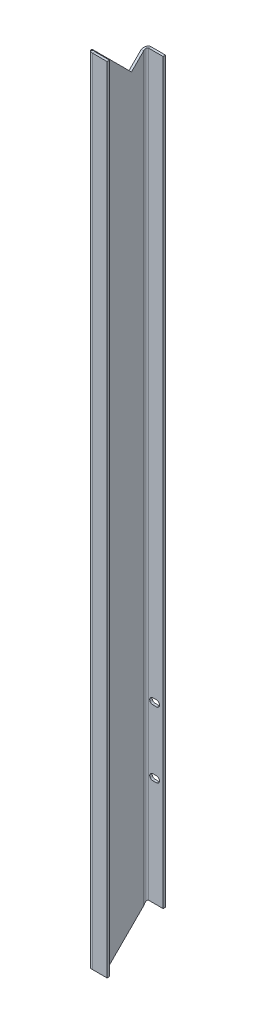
ISO-10303-21;
HEADER;
FILE_DESCRIPTION(('STEP AP214'),'2;1');
FILE_NAME('part.step','',(''),(''),'','','');
FILE_SCHEMA(('AUTOMOTIVE_DESIGN { 1 0 10303 214 1 1 1 1 }'));
ENDSEC;
DATA;
#1=APPLICATION_CONTEXT('core data for automotive mechanical design processes');
#2=APPLICATION_PROTOCOL_DEFINITION('international standard','automotive_design',2000,#1);
#3=PRODUCT_CONTEXT('',#1,'mechanical');
#4=PRODUCT('Part','Part','',(#3));
#5=PRODUCT_RELATED_PRODUCT_CATEGORY('part','',(#4));
#6=PRODUCT_DEFINITION_FORMATION('','',#4);
#7=PRODUCT_DEFINITION_CONTEXT('part definition',#1,'design');
#8=PRODUCT_DEFINITION('design','',#6,#7);
#9=PRODUCT_DEFINITION_SHAPE('','',#8);
#10=(LENGTH_UNIT() NAMED_UNIT(*) SI_UNIT(.MILLI.,.METRE.));
#11=(NAMED_UNIT(*) PLANE_ANGLE_UNIT() SI_UNIT($,.RADIAN.));
#12=(NAMED_UNIT(*) SI_UNIT($,.STERADIAN.) SOLID_ANGLE_UNIT());
#13=UNCERTAINTY_MEASURE_WITH_UNIT(LENGTH_MEASURE(1.E-05),#10,'distance_accuracy_value','');
#14=(GEOMETRIC_REPRESENTATION_CONTEXT(3) GLOBAL_UNCERTAINTY_ASSIGNED_CONTEXT((#13)) GLOBAL_UNIT_ASSIGNED_CONTEXT((#10,
#11,#12)) REPRESENTATION_CONTEXT('',''));
#15=CARTESIAN_POINT('',(0.,0.,0.));
#16=DIRECTION('',(0.,0.,1.));
#17=DIRECTION('',(1.,0.,0.));
#18=AXIS2_PLACEMENT_3D('',#15,#16,#17);
#19=CARTESIAN_POINT('',(0.,2120.9,0.));
#20=DIRECTION('',(-1.,0.,0.));
#21=DIRECTION('',(0.,0.,1.));
#22=AXIS2_PLACEMENT_3D('',#19,#20,#21);
#23=PLANE('',#22);
#24=DIRECTION('',(0.,-1.,0.));
#25=VECTOR('',#24,1.);
#26=CARTESIAN_POINT('',(0.,2120.9,-139.7));
#27=LINE('',#26,#25);
#28=CARTESIAN_POINT('',(0.,2052.8915,-139.7));
#29=VERTEX_POINT('',#28);
#30=CARTESIAN_POINT('',(0.,123.233524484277,-139.7));
#31=VERTEX_POINT('',#30);
#32=EDGE_CURVE('E253',#29,#31,#27,.T.);
#33=ORIENTED_EDGE('',*,*,#32,.T.);
#34=DIRECTION('',(0.,0.707106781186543,-0.707106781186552));
#35=VECTOR('',#34,1.);
#36=CARTESIAN_POINT('',(0.,17.9605122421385,-34.4269877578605));
#37=LINE('',#36,#35);
#38=CARTESIAN_POINT('',(0.,17.9605122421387,-34.4269877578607));
#39=VERTEX_POINT('',#38);
#40=EDGE_CURVE('E214',#39,#31,#37,.T.);
#41=ORIENTED_EDGE('',*,*,#40,.F.);
#42=DIRECTION('',(0.,0.707106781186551,0.707106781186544));
#43=VECTOR('',#42,1.);
#44=CARTESIAN_POINT('',(0.,1086.64375000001,1034.25625));
#45=LINE('',#44,#43);
#46=CARTESIAN_POINT('',(0.,39.6874999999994,-12.6999999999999));
#47=VERTEX_POINT('',#46);
#48=EDGE_CURVE('E350',#39,#47,#45,.T.);
#49=ORIENTED_EDGE('',*,*,#48,.T.);
#50=DIRECTION('',(0.,-1.,0.));
#51=VECTOR('',#50,1.);
#52=CARTESIAN_POINT('',(0.,2120.9,-12.6999999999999));
#53=LINE('',#52,#51);
#54=CARTESIAN_POINT('',(0.,2116.3915,-12.6999999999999));
#55=VERTEX_POINT('',#54);
#56=EDGE_CURVE('E250',#55,#47,#53,.T.);
#57=ORIENTED_EDGE('',*,*,#56,.F.);
#58=DIRECTION('',(0.,0.707106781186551,0.707106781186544));
#59=VECTOR('',#58,1.);
#60=CARTESIAN_POINT('',(0.,2021.1415,-107.95));
#61=LINE('',#60,#59);
#62=CARTESIAN_POINT('',(0.,2021.1415,-107.95));
#63=VERTEX_POINT('',#62);
#64=EDGE_CURVE('E389',#63,#55,#61,.T.);
#65=ORIENTED_EDGE('',*,*,#64,.F.);
#66=DIRECTION('',(0.,-0.707106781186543,0.707106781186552));
#67=VECTOR('',#66,1.);
#68=CARTESIAN_POINT('',(0.,2065.5915,-152.4));
#69=LINE('',#68,#67);
#70=EDGE_CURVE('E384',#29,#63,#69,.T.);
#71=ORIENTED_EDGE('',*,*,#70,.F.);
#72=EDGE_LOOP('',(#33,#41,#49,#57,#65,#71));
#73=FACE_BOUND('',#72,.T.);
#74=ADVANCED_FACE('F42',(#73),#23,.T.);
#75=CARTESIAN_POINT('',(6.34999999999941,2120.9,0.));
#76=DIRECTION('',(-1.,0.,0.));
#77=DIRECTION('',(0.,0.,1.));
#78=AXIS2_PLACEMENT_3D('',#75,#76,#77);
#79=PLANE('',#78);
#80=DIRECTION('',(0.,0.707106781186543,-0.707106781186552));
#81=VECTOR('',#80,1.);
#82=CARTESIAN_POINT('',(6.34999999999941,17.960512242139,-34.42698775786));
#83=LINE('',#82,#81);
#84=CARTESIAN_POINT('',(6.34999999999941,17.960512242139,-34.42698775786));
#85=VERTEX_POINT('',#84);
#86=CARTESIAN_POINT('',(6.34999999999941,123.233524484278,-139.699999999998));
#87=VERTEX_POINT('',#86);
#88=EDGE_CURVE('E57',#85,#87,#83,.T.);
#89=ORIENTED_EDGE('',*,*,#88,.T.);
#90=DIRECTION('',(0.,-1.,0.));
#91=VECTOR('',#90,1.);
#92=CARTESIAN_POINT('',(6.34999999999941,2120.9,-139.7));
#93=LINE('',#92,#91);
#94=CARTESIAN_POINT('',(6.35000000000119,2052.8915,-139.699999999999));
#95=VERTEX_POINT('',#94);
#96=EDGE_CURVE('E223',#95,#87,#93,.T.);
#97=ORIENTED_EDGE('',*,*,#96,.F.);
#98=DIRECTION('',(0.,-0.707106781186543,0.707106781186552));
#99=VECTOR('',#98,1.);
#100=CARTESIAN_POINT('',(6.35000000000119,2065.5915,-152.4));
#101=LINE('',#100,#99);
#102=CARTESIAN_POINT('',(6.35000000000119,2021.1415,-107.95));
#103=VERTEX_POINT('',#102);
#104=EDGE_CURVE('E386',#95,#103,#101,.T.);
#105=ORIENTED_EDGE('',*,*,#104,.T.);
#106=DIRECTION('',(0.,0.707106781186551,0.707106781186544));
#107=VECTOR('',#106,1.);
#108=CARTESIAN_POINT('',(6.35000000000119,2021.1415,-107.95));
#109=LINE('',#108,#107);
#110=CARTESIAN_POINT('',(6.34999999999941,2116.3915,-12.6999999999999));
#111=VERTEX_POINT('',#110);
#112=EDGE_CURVE('E388',#103,#111,#109,.T.);
#113=ORIENTED_EDGE('',*,*,#112,.T.);
#114=DIRECTION('',(0.,-1.,0.));
#115=VECTOR('',#114,1.);
#116=CARTESIAN_POINT('',(6.34999999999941,2120.9,-12.6999999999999));
#117=LINE('',#116,#115);
#118=CARTESIAN_POINT('',(6.34999999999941,39.687500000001,-12.6999999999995));
#119=VERTEX_POINT('',#118);
#120=EDGE_CURVE('E230',#111,#119,#117,.T.);
#121=ORIENTED_EDGE('',*,*,#120,.T.);
#122=DIRECTION('',(0.,0.707106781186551,0.707106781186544));
#123=VECTOR('',#122,1.);
#124=CARTESIAN_POINT('',(6.34999999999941,1086.64375000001,1034.25625));
#125=LINE('',#124,#123);
#126=EDGE_CURVE('E225',#85,#119,#125,.T.);
#127=ORIENTED_EDGE('',*,*,#126,.F.);
#128=EDGE_LOOP('',(#89,#97,#105,#113,#121,#127));
#129=FACE_BOUND('',#128,.T.);
#130=ADVANCED_FACE('F221',(#129),#79,.F.);
#131=CARTESIAN_POINT('',(0.,2120.9,-146.05));
#132=DIRECTION('',(0.,0.,-1.));
#133=DIRECTION('',(-1.,0.,0.));
#134=AXIS2_PLACEMENT_3D('',#131,#132,#133);
#135=PLANE('',#134);
#136=DIRECTION('',(-1.,0.,0.));
#137=VECTOR('',#136,1.);
#138=CARTESIAN_POINT('',(33.3375,427.037500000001,-146.05));
#139=LINE('',#138,#137);
#140=CARTESIAN_POINT('',(33.3375,427.037500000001,-146.05));
#141=VERTEX_POINT('',#140);
#142=CARTESIAN_POINT('',(23.8125,427.037500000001,-146.050000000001));
#143=VERTEX_POINT('',#142);
#144=EDGE_CURVE('E332',#141,#143,#139,.T.);
#145=ORIENTED_EDGE('',*,*,#144,.F.);
#146=CARTESIAN_POINT('',(33.3375,419.100000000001,-146.05));
#147=DIRECTION('',(0.,0.,-1.));
#148=DIRECTION('',(-1.,0.,0.));
#149=AXIS2_PLACEMENT_3D('',#146,#147,#148);
#150=CIRCLE('',#149,7.93749999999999);
#151=CARTESIAN_POINT('',(33.3375,411.1625,-146.05));
#152=VERTEX_POINT('',#151);
#153=EDGE_CURVE('E317',#152,#141,#150,.F.);
#154=ORIENTED_EDGE('',*,*,#153,.F.);
#155=DIRECTION('',(1.,0.,0.));
#156=VECTOR('',#155,1.);
#157=CARTESIAN_POINT('',(33.3375,411.1625,-146.05));
#158=LINE('',#157,#156);
#159=CARTESIAN_POINT('',(23.8125,411.162500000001,-146.05));
#160=VERTEX_POINT('',#159);
#161=EDGE_CURVE('E314',#160,#152,#158,.T.);
#162=ORIENTED_EDGE('',*,*,#161,.F.);
#163=CARTESIAN_POINT('',(23.8125,419.1,-146.05));
#164=DIRECTION('',(0.,0.,-1.));
#165=DIRECTION('',(-1.,0.,0.));
#166=AXIS2_PLACEMENT_3D('',#163,#164,#165);
#167=CIRCLE('',#166,7.93749999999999);
#168=EDGE_CURVE('E335',#143,#160,#167,.F.);
#169=ORIENTED_EDGE('',*,*,#168,.F.);
#170=EDGE_LOOP('',(#145,#154,#162,#169));
#171=FACE_BOUND('',#170,.T.);
#172=DIRECTION('',(-1.,0.,0.));
#173=VECTOR('',#172,1.);
#174=CARTESIAN_POINT('',(33.337500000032,598.487500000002,-146.05));
#175=LINE('',#174,#173);
#176=CARTESIAN_POINT('',(33.337500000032,598.487500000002,-146.05));
#177=VERTEX_POINT('',#176);
#178=CARTESIAN_POINT('',(23.812500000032,598.487500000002,-146.050000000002));
#179=VERTEX_POINT('',#178);
#180=EDGE_CURVE('E300',#177,#179,#175,.T.);
#181=ORIENTED_EDGE('',*,*,#180,.F.);
#182=CARTESIAN_POINT('',(33.337500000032,590.550000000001,-146.050000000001));
#183=DIRECTION('',(0.,0.,-1.));
#184=DIRECTION('',(-1.,0.,0.));
#185=AXIS2_PLACEMENT_3D('',#182,#183,#184);
#186=CIRCLE('',#185,7.93749999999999);
#187=CARTESIAN_POINT('',(33.337500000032,582.612500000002,-146.050000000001));
#188=VERTEX_POINT('',#187);
#189=EDGE_CURVE('E308',#188,#177,#186,.F.);
#190=ORIENTED_EDGE('',*,*,#189,.F.);
#191=DIRECTION('',(1.,0.,0.));
#192=VECTOR('',#191,1.);
#193=CARTESIAN_POINT('',(33.337500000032,582.612500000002,-146.050000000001));
#194=LINE('',#193,#192);
#195=CARTESIAN_POINT('',(23.812500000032,582.612500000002,-146.050000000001));
#196=VERTEX_POINT('',#195);
#197=EDGE_CURVE('E215',#196,#188,#194,.T.);
#198=ORIENTED_EDGE('',*,*,#197,.F.);
#199=CARTESIAN_POINT('',(23.812500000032,590.550000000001,-146.050000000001));
#200=DIRECTION('',(0.,0.,-1.));
#201=DIRECTION('',(-1.,0.,0.));
#202=AXIS2_PLACEMENT_3D('',#199,#200,#201);
#203=CIRCLE('',#202,7.93749999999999);
#204=EDGE_CURVE('E65',#179,#196,#203,.F.);
#205=ORIENTED_EDGE('',*,*,#204,.F.);
#206=EDGE_LOOP('',(#181,#190,#198,#205));
#207=FACE_BOUND('',#206,.T.);
#208=DIRECTION('',(-1.,0.,0.));
#209=VECTOR('',#208,1.);
#210=CARTESIAN_POINT('',(0.,135.933524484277,-146.049999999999));
#211=LINE('',#210,#209);
#212=CARTESIAN_POINT('',(50.8000000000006,135.933524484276,-146.05));
#213=VERTEX_POINT('',#212);
#214=CARTESIAN_POINT('',(12.7000000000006,135.933524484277,-146.05));
#215=VERTEX_POINT('',#214);
#216=EDGE_CURVE('E275',#213,#215,#211,.T.);
#217=ORIENTED_EDGE('',*,*,#216,.F.);
#218=DIRECTION('',(0.,-1.,0.));
#219=VECTOR('',#218,1.);
#220=CARTESIAN_POINT('',(50.8000000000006,2120.9,-146.05));
#221=LINE('',#220,#219);
#222=CARTESIAN_POINT('',(50.8000000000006,2059.2415,-146.050000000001));
#223=VERTEX_POINT('',#222);
#224=EDGE_CURVE('E50',#223,#213,#221,.T.);
#225=ORIENTED_EDGE('',*,*,#224,.F.);
#226=DIRECTION('',(-1.,0.,0.));
#227=VECTOR('',#226,1.);
#228=CARTESIAN_POINT('',(0.,2059.2415,-146.049999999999));
#229=LINE('',#228,#227);
#230=CARTESIAN_POINT('',(12.7000000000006,2059.2415,-146.050000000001));
#231=VERTEX_POINT('',#230);
#232=EDGE_CURVE('E274',#223,#231,#229,.T.);
#233=ORIENTED_EDGE('',*,*,#232,.T.);
#234=DIRECTION('',(0.,-1.,0.));
#235=VECTOR('',#234,1.);
#236=CARTESIAN_POINT('',(12.7000000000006,2120.9,-146.05));
#237=LINE('',#236,#235);
#238=EDGE_CURVE('E231',#231,#215,#237,.T.);
#239=ORIENTED_EDGE('',*,*,#238,.T.);
#240=EDGE_LOOP('',(#217,#225,#233,#239));
#241=FACE_BOUND('',#240,.T.);
#242=ADVANCED_FACE('F273',(#171,#207,#241),#135,.F.);
#243=CARTESIAN_POINT('',(50.8000000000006,2120.9,-152.4));
#244=DIRECTION('',(1.,0.,0.));
#245=DIRECTION('',(0.,0.,-1.));
#246=AXIS2_PLACEMENT_3D('',#243,#244,#245);
#247=PLANE('',#246);
#248=ORIENTED_EDGE('',*,*,#224,.T.);
#249=DIRECTION('',(0.,0.,-1.));
#250=VECTOR('',#249,1.);
#251=CARTESIAN_POINT('',(50.8000000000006,135.933524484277,-152.4));
#252=LINE('',#251,#250);
#253=CARTESIAN_POINT('',(50.8000000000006,135.933524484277,-152.4));
#254=VERTEX_POINT('',#253);
#255=EDGE_CURVE('E268',#254,#213,#252,.F.);
#256=ORIENTED_EDGE('',*,*,#255,.F.);
#257=DIRECTION('',(0.,-1.,0.));
#258=VECTOR('',#257,1.);
#259=CARTESIAN_POINT('',(50.8000000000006,2120.9,-152.4));
#260=LINE('',#259,#258);
#261=CARTESIAN_POINT('',(50.8000000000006,2059.2415,-152.4));
#262=VERTEX_POINT('',#261);
#263=EDGE_CURVE('E259',#262,#254,#260,.T.);
#264=ORIENTED_EDGE('',*,*,#263,.F.);
#265=DIRECTION('',(0.,0.,1.));
#266=VECTOR('',#265,1.);
#267=CARTESIAN_POINT('',(50.8000000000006,2059.2415,-146.050000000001));
#268=LINE('',#267,#266);
#269=EDGE_CURVE('E269',#223,#262,#268,.F.);
#270=ORIENTED_EDGE('',*,*,#269,.F.);
#271=EDGE_LOOP('',(#248,#256,#264,#270));
#272=FACE_BOUND('',#271,.T.);
#273=ADVANCED_FACE('F266',(#272),#247,.T.);
#274=CARTESIAN_POINT('',(0.,2120.9,-152.4));
#275=DIRECTION('',(0.,0.,-1.));
#276=DIRECTION('',(-1.,0.,0.));
#277=AXIS2_PLACEMENT_3D('',#274,#275,#276);
#278=PLANE('',#277);
#279=CARTESIAN_POINT('',(33.3375,419.1,-152.4));
#280=DIRECTION('',(0.,0.,-1.));
#281=DIRECTION('',(-1.,0.,0.));
#282=AXIS2_PLACEMENT_3D('',#279,#280,#281);
#283=CIRCLE('',#282,7.93749999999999);
#284=CARTESIAN_POINT('',(33.3375,427.0375,-152.400000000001));
#285=VERTEX_POINT('',#284);
#286=CARTESIAN_POINT('',(33.3375,411.1625,-152.4));
#287=VERTEX_POINT('',#286);
#288=EDGE_CURVE('E327',#285,#287,#283,.T.);
#289=ORIENTED_EDGE('',*,*,#288,.F.);
#290=DIRECTION('',(1.,0.,0.));
#291=VECTOR('',#290,1.);
#292=CARTESIAN_POINT('',(33.3375,427.0375,-152.400000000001));
#293=LINE('',#292,#291);
#294=CARTESIAN_POINT('',(23.8125,427.0375,-152.400000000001));
#295=VERTEX_POINT('',#294);
#296=EDGE_CURVE('E318',#295,#285,#293,.T.);
#297=ORIENTED_EDGE('',*,*,#296,.F.);
#298=CARTESIAN_POINT('',(23.8125,419.100000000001,-152.400000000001));
#299=DIRECTION('',(0.,0.,-1.));
#300=DIRECTION('',(-1.,0.,0.));
#301=AXIS2_PLACEMENT_3D('',#298,#299,#300);
#302=CIRCLE('',#301,7.93749999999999);
#303=CARTESIAN_POINT('',(23.8125,411.1625,-152.4));
#304=VERTEX_POINT('',#303);
#305=EDGE_CURVE('E321',#304,#295,#302,.T.);
#306=ORIENTED_EDGE('',*,*,#305,.F.);
#307=DIRECTION('',(-1.,0.,0.));
#308=VECTOR('',#307,1.);
#309=CARTESIAN_POINT('',(33.3375,411.1625,-152.4));
#310=LINE('',#309,#308);
#311=EDGE_CURVE('E324',#287,#304,#310,.T.);
#312=ORIENTED_EDGE('',*,*,#311,.F.);
#313=EDGE_LOOP('',(#289,#297,#306,#312));
#314=FACE_BOUND('',#313,.T.);
#315=CARTESIAN_POINT('',(33.337500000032,590.550000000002,-152.4));
#316=DIRECTION('',(0.,0.,-1.));
#317=DIRECTION('',(-1.,0.,0.));
#318=AXIS2_PLACEMENT_3D('',#315,#316,#317);
#319=CIRCLE('',#318,7.93749999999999);
#320=CARTESIAN_POINT('',(33.337500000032,598.487500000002,-152.400000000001));
#321=VERTEX_POINT('',#320);
#322=CARTESIAN_POINT('',(33.337500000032,582.612500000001,-152.4));
#323=VERTEX_POINT('',#322);
#324=EDGE_CURVE('E311',#321,#323,#319,.T.);
#325=ORIENTED_EDGE('',*,*,#324,.F.);
#326=DIRECTION('',(1.,0.,0.));
#327=VECTOR('',#326,1.);
#328=CARTESIAN_POINT('',(33.337500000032,598.487500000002,-152.400000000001));
#329=LINE('',#328,#327);
#330=CARTESIAN_POINT('',(23.812500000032,598.487500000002,-152.400000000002));
#331=VERTEX_POINT('',#330);
#332=EDGE_CURVE('E303',#331,#321,#329,.T.);
#333=ORIENTED_EDGE('',*,*,#332,.F.);
#334=CARTESIAN_POINT('',(23.812500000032,590.550000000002,-152.400000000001));
#335=DIRECTION('',(0.,0.,-1.));
#336=DIRECTION('',(-1.,0.,0.));
#337=AXIS2_PLACEMENT_3D('',#334,#335,#336);
#338=CIRCLE('',#337,7.93749999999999);
#339=CARTESIAN_POINT('',(23.812500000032,582.612500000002,-152.400000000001));
#340=VERTEX_POINT('',#339);
#341=EDGE_CURVE('E295',#340,#331,#338,.T.);
#342=ORIENTED_EDGE('',*,*,#341,.F.);
#343=DIRECTION('',(-1.,0.,0.));
#344=VECTOR('',#343,1.);
#345=CARTESIAN_POINT('',(33.337500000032,582.612500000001,-152.4));
#346=LINE('',#345,#344);
#347=EDGE_CURVE('E287',#323,#340,#346,.T.);
#348=ORIENTED_EDGE('',*,*,#347,.F.);
#349=EDGE_LOOP('',(#325,#333,#342,#348));
#350=FACE_BOUND('',#349,.T.);
#351=ORIENTED_EDGE('',*,*,#263,.T.);
#352=DIRECTION('',(-1.,0.,0.));
#353=VECTOR('',#352,1.);
#354=CARTESIAN_POINT('',(50.8000000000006,135.933524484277,-152.4));
#355=LINE('',#354,#353);
#356=CARTESIAN_POINT('',(12.7000000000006,135.933524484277,-152.4));
#357=VERTEX_POINT('',#356);
#358=EDGE_CURVE('E209',#254,#357,#355,.T.);
#359=ORIENTED_EDGE('',*,*,#358,.T.);
#360=DIRECTION('',(0.,-1.,0.));
#361=VECTOR('',#360,1.);
#362=CARTESIAN_POINT('',(12.7000000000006,2120.9,-152.400000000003));
#363=LINE('',#362,#361);
#364=CARTESIAN_POINT('',(12.7000000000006,2059.2415,-152.400000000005));
#365=VERTEX_POINT('',#364);
#366=EDGE_CURVE('E256',#365,#357,#363,.T.);
#367=ORIENTED_EDGE('',*,*,#366,.F.);
#368=DIRECTION('',(-1.,0.,0.));
#369=VECTOR('',#368,1.);
#370=CARTESIAN_POINT('',(0.,2059.2415,-152.4));
#371=LINE('',#370,#369);
#372=EDGE_CURVE('E378',#262,#365,#371,.T.);
#373=ORIENTED_EDGE('',*,*,#372,.F.);
#374=EDGE_LOOP('',(#351,#359,#367,#373));
#375=FACE_BOUND('',#374,.T.);
#376=ADVANCED_FACE('F468',(#314,#350,#375),#278,.T.);
#377=CARTESIAN_POINT('',(12.7000000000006,2120.9,-139.700000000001));
#378=DIRECTION('',(0.,-1.,0.));
#379=DIRECTION('',(0.,0.,-1.));
#380=AXIS2_PLACEMENT_3D('',#377,#378,#379);
#381=CYLINDRICAL_SURFACE('',#380,12.7);
#382=ORIENTED_EDGE('',*,*,#366,.T.);
#383=CARTESIAN_POINT('',(12.7000000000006,123.233524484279,-139.700000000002));
#384=DIRECTION('',(0.,0.707106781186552,0.707106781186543));
#385=DIRECTION('',(0.,-0.707106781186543,0.707106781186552));
#386=AXIS2_PLACEMENT_3D('',#383,#384,#385);
#387=ELLIPSE('',#386,17.9605122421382,12.7);
#388=EDGE_CURVE('E210',#31,#357,#387,.F.);
#389=ORIENTED_EDGE('',*,*,#388,.F.);
#390=ORIENTED_EDGE('',*,*,#32,.F.);
#391=CARTESIAN_POINT('',(12.7000000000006,2052.8915,-139.7));
#392=DIRECTION('',(0.,-0.89442719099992,-0.44721359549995));
#393=DIRECTION('',(0.,-0.44721359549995,0.89442719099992));
#394=AXIS2_PLACEMENT_3D('',#391,#392,#393);
#395=ELLIPSE('',#394,14.1990316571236,12.7);
#396=EDGE_CURVE('E374',#365,#29,#395,.F.);
#397=ORIENTED_EDGE('',*,*,#396,.F.);
#398=EDGE_LOOP('',(#382,#389,#390,#397));
#399=FACE_BOUND('',#398,.T.);
#400=ADVANCED_FACE('F464',(#399),#381,.T.);
#401=CARTESIAN_POINT('',(12.7000000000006,2120.9,-139.700000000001));
#402=DIRECTION('',(0.,-1.,0.));
#403=DIRECTION('',(0.,0.,-1.));
#404=AXIS2_PLACEMENT_3D('',#401,#402,#403);
#405=CYLINDRICAL_SURFACE('',#404,6.35);
#406=CARTESIAN_POINT('',(12.7000000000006,123.233524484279,-139.700000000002));
#407=DIRECTION('',(0.,0.447213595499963,0.894427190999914));
#408=DIRECTION('',(0.,-0.894427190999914,0.447213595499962));
#409=AXIS2_PLACEMENT_3D('',#406,#407,#408);
#410=ELLIPSE('',#409,14.1990316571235,6.35);
#411=EDGE_CURVE('E199',#87,#215,#410,.F.);
#412=ORIENTED_EDGE('',*,*,#411,.T.);
#413=ORIENTED_EDGE('',*,*,#238,.F.);
#414=CARTESIAN_POINT('',(12.7000000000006,2052.8915,-139.7));
#415=DIRECTION('',(0.,-0.707106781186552,-0.707106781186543));
#416=DIRECTION('',(0.,-0.707106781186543,0.707106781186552));
#417=AXIS2_PLACEMENT_3D('',#414,#415,#416);
#418=ELLIPSE('',#417,8.9802561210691,6.35);
#419=EDGE_CURVE('E229',#231,#95,#418,.F.);
#420=ORIENTED_EDGE('',*,*,#419,.T.);
#421=ORIENTED_EDGE('',*,*,#96,.T.);
#422=EDGE_LOOP('',(#412,#413,#420,#421));
#423=FACE_BOUND('',#422,.T.);
#424=ADVANCED_FACE('F228',(#423),#405,.F.);
#425=CARTESIAN_POINT('',(6.34999999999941,1086.64375000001,1034.25625));
#426=DIRECTION('',(0.,-0.707106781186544,0.707106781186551));
#427=DIRECTION('',(0.,0.707106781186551,0.707106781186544));
#428=AXIS2_PLACEMENT_3D('',#425,#426,#427);
#429=PLANE('',#428);
#430=ORIENTED_EDGE('',*,*,#48,.F.);
#431=DIRECTION('',(-1.,0.,0.));
#432=VECTOR('',#431,1.);
#433=CARTESIAN_POINT('',(0.,17.9605122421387,-34.4269877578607));
#434=LINE('',#433,#432);
#435=EDGE_CURVE('E216',#39,#85,#434,.F.);
#436=ORIENTED_EDGE('',*,*,#435,.T.);
#437=ORIENTED_EDGE('',*,*,#126,.T.);
#438=DIRECTION('',(1.,0.,0.));
#439=VECTOR('',#438,1.);
#440=CARTESIAN_POINT('',(6.34999999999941,39.6875000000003,-12.699999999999));
#441=LINE('',#440,#439);
#442=EDGE_CURVE('E352',#119,#47,#441,.F.);
#443=ORIENTED_EDGE('',*,*,#442,.T.);
#444=EDGE_LOOP('',(#430,#436,#437,#443));
#445=FACE_BOUND('',#444,.T.);
#446=ADVANCED_FACE('F461',(#445),#429,.T.);
#447=CARTESIAN_POINT('',(12.7000000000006,2120.9,-12.7000000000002));
#448=DIRECTION('',(0.,-1.,0.));
#449=DIRECTION('',(0.,0.,-1.));
#450=AXIS2_PLACEMENT_3D('',#447,#448,#449);
#451=CYLINDRICAL_SURFACE('',#450,12.7);
#452=ORIENTED_EDGE('',*,*,#56,.T.);
#453=CARTESIAN_POINT('',(12.7000000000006,39.6875000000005,-12.700000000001));
#454=DIRECTION('',(0.,-0.707106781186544,0.707106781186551));
#455=DIRECTION('',(0.,-0.707106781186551,-0.707106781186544));
#456=AXIS2_PLACEMENT_3D('',#453,#454,#455);
#457=ELLIPSE('',#456,17.9605122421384,12.7);
#458=CARTESIAN_POINT('',(12.7000000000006,52.3875000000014,-1.77635683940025E-12));
#459=VERTEX_POINT('',#458);
#460=EDGE_CURVE('E337',#47,#459,#457,.F.);
#461=ORIENTED_EDGE('',*,*,#460,.T.);
#462=DIRECTION('',(0.,-1.,0.));
#463=VECTOR('',#462,1.);
#464=CARTESIAN_POINT('',(12.7000000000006,2120.9,-4.44089209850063E-13));
#465=LINE('',#464,#463);
#466=CARTESIAN_POINT('',(12.7000000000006,2120.9,-4.44089209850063E-13));
#467=VERTEX_POINT('',#466);
#468=EDGE_CURVE('E247',#467,#459,#465,.T.);
#469=ORIENTED_EDGE('',*,*,#468,.F.);
#470=CARTESIAN_POINT('',(12.7000000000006,2120.9,-12.7000000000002));
#471=DIRECTION('',(0.,1.,0.));
#472=DIRECTION('',(0.,0.,1.));
#473=AXIS2_PLACEMENT_3D('',#470,#471,#472);
#474=CIRCLE('',#473,12.7);
#475=CARTESIAN_POINT('',(3.75663871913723,2120.9,-3.6830000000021));
#476=VERTEX_POINT('',#475);
#477=EDGE_CURVE('E401',#467,#476,#474,.F.);
#478=ORIENTED_EDGE('',*,*,#477,.T.);
#479=CARTESIAN_POINT('',(12.7000000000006,2116.3915,-12.7000000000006));
#480=DIRECTION('',(0.,-0.89442719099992,0.44721359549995));
#481=DIRECTION('',(0.,-0.44721359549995,-0.89442719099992));
#482=AXIS2_PLACEMENT_3D('',#479,#480,#481);
#483=ELLIPSE('',#482,14.1990316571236,12.7);
#484=EDGE_CURVE('E367',#55,#476,#483,.F.);
#485=ORIENTED_EDGE('',*,*,#484,.F.);
#486=EDGE_LOOP('',(#452,#461,#469,#478,#485));
#487=FACE_BOUND('',#486,.T.);
#488=ADVANCED_FACE('F440',(#487),#451,.T.);
#489=CARTESIAN_POINT('',(12.7000000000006,2120.9,-12.7000000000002));
#490=DIRECTION('',(0.,-1.,0.));
#491=DIRECTION('',(0.,0.,-1.));
#492=AXIS2_PLACEMENT_3D('',#489,#490,#491);
#493=CYLINDRICAL_SURFACE('',#492,6.35);
#494=CARTESIAN_POINT('',(12.7000000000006,39.6875000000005,-12.700000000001));
#495=DIRECTION('',(0.,-0.447213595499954,0.894427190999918));
#496=DIRECTION('',(0.,-0.894427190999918,-0.447213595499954));
#497=AXIS2_PLACEMENT_3D('',#494,#495,#496);
#498=ELLIPSE('',#497,14.1990316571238,6.35);
#499=CARTESIAN_POINT('',(12.7000000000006,52.3875000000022,-6.3500000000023));
#500=VERTEX_POINT('',#499);
#501=EDGE_CURVE('E345',#119,#500,#498,.F.);
#502=ORIENTED_EDGE('',*,*,#501,.F.);
#503=ORIENTED_EDGE('',*,*,#120,.F.);
#504=CARTESIAN_POINT('',(12.7000000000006,2116.3915,-12.7000000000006));
#505=DIRECTION('',(0.,-0.707106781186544,0.707106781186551));
#506=DIRECTION('',(0.,-0.707106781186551,-0.707106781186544));
#507=AXIS2_PLACEMENT_3D('',#504,#505,#506);
#508=ELLIPSE('',#507,8.9802561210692,6.35);
#509=CARTESIAN_POINT('',(8.22831935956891,2120.9,-8.19150000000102));
#510=VERTEX_POINT('',#509);
#511=EDGE_CURVE('E365',#111,#510,#508,.F.);
#512=ORIENTED_EDGE('',*,*,#511,.T.);
#513=CARTESIAN_POINT('',(12.7000000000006,2120.9,-12.7000000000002));
#514=DIRECTION('',(0.,1.,0.));
#515=DIRECTION('',(1.,0.,0.));
#516=AXIS2_PLACEMENT_3D('',#513,#514,#515);
#517=CIRCLE('',#516,6.35);
#518=CARTESIAN_POINT('',(12.7000000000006,2120.9,-6.35000000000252));
#519=VERTEX_POINT('',#518);
#520=EDGE_CURVE('E235',#519,#510,#517,.F.);
#521=ORIENTED_EDGE('',*,*,#520,.F.);
#522=DIRECTION('',(0.,-1.,0.));
#523=VECTOR('',#522,1.);
#524=CARTESIAN_POINT('',(12.7000000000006,2120.9,-6.35000000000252));
#525=LINE('',#524,#523);
#526=EDGE_CURVE('E233',#519,#500,#525,.T.);
#527=ORIENTED_EDGE('',*,*,#526,.T.);
#528=EDGE_LOOP('',(#502,#503,#512,#521,#527));
#529=FACE_BOUND('',#528,.T.);
#530=ADVANCED_FACE('F420',(#529),#493,.F.);
#531=CARTESIAN_POINT('',(50.8000000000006,2120.9,0.));
#532=DIRECTION('',(0.,0.,1.));
#533=DIRECTION('',(1.,0.,0.));
#534=AXIS2_PLACEMENT_3D('',#531,#532,#533);
#535=PLANE('',#534);
#536=ORIENTED_EDGE('',*,*,#468,.T.);
#537=DIRECTION('',(1.,0.,0.));
#538=VECTOR('',#537,1.);
#539=CARTESIAN_POINT('',(0.,52.3875,6.66133814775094E-13));
#540=LINE('',#539,#538);
#541=CARTESIAN_POINT('',(50.7999999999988,52.3875000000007,0.));
#542=VERTEX_POINT('',#541);
#543=EDGE_CURVE('E356',#459,#542,#540,.T.);
#544=ORIENTED_EDGE('',*,*,#543,.T.);
#545=DIRECTION('',(0.,-1.,0.));
#546=VECTOR('',#545,1.);
#547=CARTESIAN_POINT('',(50.8000000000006,2120.9,0.));
#548=LINE('',#547,#546);
#549=CARTESIAN_POINT('',(50.8000000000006,2120.9,0.));
#550=VERTEX_POINT('',#549);
#551=EDGE_CURVE('E244',#550,#542,#548,.T.);
#552=ORIENTED_EDGE('',*,*,#551,.F.);
#553=DIRECTION('',(-1.,0.,0.));
#554=VECTOR('',#553,1.);
#555=CARTESIAN_POINT('',(50.8000000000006,2120.9,0.));
#556=LINE('',#555,#554);
#557=EDGE_CURVE('E406',#550,#467,#556,.T.);
#558=ORIENTED_EDGE('',*,*,#557,.T.);
#559=EDGE_LOOP('',(#536,#544,#552,#558));
#560=FACE_BOUND('',#559,.T.);
#561=ADVANCED_FACE('F444',(#560),#535,.T.);
#562=CARTESIAN_POINT('',(50.8000000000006,2120.9,-6.3500000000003));
#563=DIRECTION('',(1.,0.,0.));
#564=DIRECTION('',(0.,0.,-1.));
#565=AXIS2_PLACEMENT_3D('',#562,#563,#564);
#566=PLANE('',#565);
#567=ORIENTED_EDGE('',*,*,#551,.T.);
#568=DIRECTION('',(0.,0.,1.));
#569=VECTOR('',#568,1.);
#570=CARTESIAN_POINT('',(50.7999999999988,52.3875000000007,0.));
#571=LINE('',#570,#569);
#572=CARTESIAN_POINT('',(50.8000000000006,52.3875000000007,-6.34999999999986));
#573=VERTEX_POINT('',#572);
#574=EDGE_CURVE('E362',#542,#573,#571,.F.);
#575=ORIENTED_EDGE('',*,*,#574,.T.);
#576=DIRECTION('',(0.,-1.,0.));
#577=VECTOR('',#576,1.);
#578=CARTESIAN_POINT('',(50.8000000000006,2120.9,-6.3500000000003));
#579=LINE('',#578,#577);
#580=CARTESIAN_POINT('',(50.8000000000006,2120.9,-6.3500000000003));
#581=VERTEX_POINT('',#580);
#582=EDGE_CURVE('E241',#581,#573,#579,.T.);
#583=ORIENTED_EDGE('',*,*,#582,.F.);
#584=DIRECTION('',(0.,0.,1.));
#585=VECTOR('',#584,1.);
#586=CARTESIAN_POINT('',(50.8000000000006,2120.9,-6.3500000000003));
#587=LINE('',#586,#585);
#588=EDGE_CURVE('E409',#581,#550,#587,.T.);
#589=ORIENTED_EDGE('',*,*,#588,.T.);
#590=EDGE_LOOP('',(#567,#575,#583,#589));
#591=FACE_BOUND('',#590,.T.);
#592=ADVANCED_FACE('F449',(#591),#566,.T.);
#593=CARTESIAN_POINT('',(50.8000000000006,2120.9,-6.3500000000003));
#594=DIRECTION('',(0.,0.,1.));
#595=DIRECTION('',(1.,0.,0.));
#596=AXIS2_PLACEMENT_3D('',#593,#594,#595);
#597=PLANE('',#596);
#598=DIRECTION('',(1.,0.,0.));
#599=VECTOR('',#598,1.);
#600=CARTESIAN_POINT('',(50.8000000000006,52.3875000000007,-6.34999999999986));
#601=LINE('',#600,#599);
#602=EDGE_CURVE('E357',#500,#573,#601,.T.);
#603=ORIENTED_EDGE('',*,*,#602,.F.);
#604=ORIENTED_EDGE('',*,*,#526,.F.);
#605=DIRECTION('',(-1.,0.,0.));
#606=VECTOR('',#605,1.);
#607=CARTESIAN_POINT('',(50.8000000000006,2120.9,-6.3500000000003));
#608=LINE('',#607,#606);
#609=EDGE_CURVE('E412',#581,#519,#608,.T.);
#610=ORIENTED_EDGE('',*,*,#609,.F.);
#611=ORIENTED_EDGE('',*,*,#582,.T.);
#612=EDGE_LOOP('',(#603,#604,#610,#611));
#613=FACE_BOUND('',#612,.T.);
#614=ADVANCED_FACE('F453',(#613),#597,.F.);
#615=CARTESIAN_POINT('',(0.,2120.9,-12.6999999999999));
#616=DIRECTION('',(0.,1.,0.));
#617=DIRECTION('',(0.,0.,1.));
#618=AXIS2_PLACEMENT_3D('',#615,#616,#617);
#619=PLANE('',#618);
#620=ORIENTED_EDGE('',*,*,#520,.T.);
#621=DIRECTION('',(0.704201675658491,0.,-0.709999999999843));
#622=VECTOR('',#621,1.);
#623=CARTESIAN_POINT('',(8.22831935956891,2120.9,-8.19150000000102));
#624=LINE('',#623,#622);
#625=EDGE_CURVE('E369',#510,#476,#624,.F.);
#626=ORIENTED_EDGE('',*,*,#625,.T.);
#627=ORIENTED_EDGE('',*,*,#477,.F.);
#628=DIRECTION('',(0.,0.,1.));
#629=VECTOR('',#628,1.);
#630=CARTESIAN_POINT('',(12.7000000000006,2120.9,-6.35000000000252));
#631=LINE('',#630,#629);
#632=EDGE_CURVE('E11',#519,#467,#631,.T.);
#633=ORIENTED_EDGE('',*,*,#632,.F.);
#634=EDGE_LOOP('',(#620,#626,#627,#633));
#635=FACE_BOUND('',#634,.T.);
#636=ADVANCED_FACE('F44',(#635),#619,.T.);
#637=CARTESIAN_POINT('',(12.7000000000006,2120.9,-139.700000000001));
#638=DIRECTION('',(0.,1.,0.));
#639=DIRECTION('',(1.,0.,0.));
#640=AXIS2_PLACEMENT_3D('',#637,#638,#639);
#641=PLANE('',#640);
#642=ORIENTED_EDGE('',*,*,#609,.T.);
#643=ORIENTED_EDGE('',*,*,#632,.T.);
#644=ORIENTED_EDGE('',*,*,#557,.F.);
#645=ORIENTED_EDGE('',*,*,#588,.F.);
#646=EDGE_LOOP('',(#642,#643,#644,#645));
#647=FACE_BOUND('',#646,.T.);
#648=ADVANCED_FACE('F447',(#647),#641,.T.);
#649=CARTESIAN_POINT('',(0.,2065.5915,-152.4));
#650=DIRECTION('',(0.,-0.707106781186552,-0.707106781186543));
#651=DIRECTION('',(0.,-0.707106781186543,0.707106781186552));
#652=AXIS2_PLACEMENT_3D('',#649,#650,#651);
#653=PLANE('',#652);
#654=DIRECTION('',(-1.,0.,0.));
#655=VECTOR('',#654,1.);
#656=CARTESIAN_POINT('',(0.,2052.8915,-139.7));
#657=LINE('',#656,#655);
#658=EDGE_CURVE('E396',#29,#95,#657,.F.);
#659=ORIENTED_EDGE('',*,*,#658,.F.);
#660=ORIENTED_EDGE('',*,*,#70,.T.);
#661=DIRECTION('',(-1.,0.,0.));
#662=VECTOR('',#661,1.);
#663=CARTESIAN_POINT('',(0.,2021.1415,-107.95));
#664=LINE('',#663,#662);
#665=EDGE_CURVE('E392',#63,#103,#664,.F.);
#666=ORIENTED_EDGE('',*,*,#665,.T.);
#667=ORIENTED_EDGE('',*,*,#104,.F.);
#668=EDGE_LOOP('',(#659,#660,#666,#667));
#669=FACE_BOUND('',#668,.T.);
#670=ADVANCED_FACE('F432',(#669),#653,.F.);
#671=CARTESIAN_POINT('',(0.,2021.1415,-107.95));
#672=DIRECTION('',(0.,-0.707106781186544,0.707106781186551));
#673=DIRECTION('',(0.,0.707106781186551,0.707106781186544));
#674=AXIS2_PLACEMENT_3D('',#671,#672,#673);
#675=PLANE('',#674);
#676=ORIENTED_EDGE('',*,*,#64,.T.);
#677=DIRECTION('',(-1.,0.,0.));
#678=VECTOR('',#677,1.);
#679=CARTESIAN_POINT('',(0.,2116.3915,-12.6999999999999));
#680=LINE('',#679,#678);
#681=EDGE_CURVE('E398',#55,#111,#680,.F.);
#682=ORIENTED_EDGE('',*,*,#681,.T.);
#683=ORIENTED_EDGE('',*,*,#112,.F.);
#684=ORIENTED_EDGE('',*,*,#665,.F.);
#685=EDGE_LOOP('',(#676,#682,#683,#684));
#686=FACE_BOUND('',#685,.T.);
#687=ADVANCED_FACE('F426',(#686),#675,.F.);
#688=CARTESIAN_POINT('',(0.,2059.2415,-146.049999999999));
#689=DIRECTION('',(0.,-1.,0.));
#690=DIRECTION('',(-1.,0.,0.));
#691=AXIS2_PLACEMENT_3D('',#688,#689,#690);
#692=PLANE('',#691);
#693=DIRECTION('',(0.,0.,1.));
#694=VECTOR('',#693,1.);
#695=CARTESIAN_POINT('',(12.7000000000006,2059.2415,-146.050000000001));
#696=LINE('',#695,#694);
#697=EDGE_CURVE('E381',#231,#365,#696,.F.);
#698=ORIENTED_EDGE('',*,*,#697,.F.);
#699=ORIENTED_EDGE('',*,*,#232,.F.);
#700=ORIENTED_EDGE('',*,*,#269,.T.);
#701=ORIENTED_EDGE('',*,*,#372,.T.);
#702=EDGE_LOOP('',(#698,#699,#700,#701));
#703=FACE_BOUND('',#702,.T.);
#704=ADVANCED_FACE('F472',(#703),#692,.F.);
#705=CARTESIAN_POINT('',(12.7000000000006,2046.5415,-127.000000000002));
#706=CARTESIAN_POINT('',(12.7000000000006,2046.5415,-129.116666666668));
#707=CARTESIAN_POINT('',(12.7000000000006,2046.5415,-131.233333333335));
#708=CARTESIAN_POINT('',(12.7000000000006,2046.5415,-133.350000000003));
#709=CARTESIAN_POINT('',(38.1000000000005,2046.5415,-127.));
#710=CARTESIAN_POINT('',(33.8666666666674,2046.5415,-129.116666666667));
#711=CARTESIAN_POINT('',(29.6333333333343,2046.5415,-131.233333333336));
#712=CARTESIAN_POINT('',(25.4000000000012,2046.5415,-133.35));
#713=CARTESIAN_POINT('',(38.1000000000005,2059.2415,-152.4));
#714=CARTESIAN_POINT('',(33.8666666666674,2059.2415,-150.283333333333));
#715=CARTESIAN_POINT('',(29.6333333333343,2059.2415,-148.166666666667));
#716=CARTESIAN_POINT('',(25.4000000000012,2059.2415,-146.05));
#717=CARTESIAN_POINT('',(12.7000000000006,2059.2415,-152.400000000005));
#718=CARTESIAN_POINT('',(12.7000000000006,2059.2415,-150.283333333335));
#719=CARTESIAN_POINT('',(12.7000000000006,2059.2415,-148.166666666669));
#720=CARTESIAN_POINT('',(12.7000000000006,2059.2415,-146.050000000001));
#721=CARTESIAN_POINT('',(-12.6999999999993,2059.2415,-152.4));
#722=CARTESIAN_POINT('',(-8.46666666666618,2059.2415,-150.283333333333));
#723=CARTESIAN_POINT('',(-4.23333333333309,2059.2415,-148.166666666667));
#724=CARTESIAN_POINT('',(0.,2059.2415,-146.049999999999));
#725=CARTESIAN_POINT('',(-12.6999999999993,2046.5415,-127.));
#726=CARTESIAN_POINT('',(-8.46666666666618,2046.5415,-129.116666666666));
#727=CARTESIAN_POINT('',(-4.23333333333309,2046.5415,-131.233333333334));
#728=CARTESIAN_POINT('',(0.,2046.5415,-133.349999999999));
#729=CARTESIAN_POINT('',(12.7000000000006,2046.5415,-127.000000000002));
#730=CARTESIAN_POINT('',(12.7000000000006,2046.5415,-129.116666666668));
#731=CARTESIAN_POINT('',(12.7000000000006,2046.5415,-131.233333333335));
#732=CARTESIAN_POINT('',(12.7000000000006,2046.5415,-133.350000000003));
#733=(BOUNDED_SURFACE() B_SPLINE_SURFACE(3,3,((#705,#706,#707,#708),(#709,#710,#711,#712),(#713,
#714,#715,#716),(#717,#718,#719,#720),(#721,#722,#723,#724),(#725,#726,#727,#728),(#729,#730,
#731,#732)),.UNSPECIFIED.,.T.,.F.,.F.) B_SPLINE_SURFACE_WITH_KNOTS((4,3,4),(4,4),(0.,0.5,1.),
(0.,1.),.UNSPECIFIED.) GEOMETRIC_REPRESENTATION_ITEM() RATIONAL_B_SPLINE_SURFACE(((1.,1.,1.,1.),
(0.333333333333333,0.333333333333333,0.333333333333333,0.333333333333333),(0.333333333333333,
0.333333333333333,0.333333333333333,0.333333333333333),(1.,1.,1.,1.),(0.333333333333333,
0.333333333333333,0.333333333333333,0.333333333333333),(0.333333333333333,0.333333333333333,
0.333333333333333,0.333333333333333),(1.,1.,1.,1.))) REPRESENTATION_ITEM('') SURFACE());
#734=ORIENTED_EDGE('',*,*,#658,.T.);
#735=ORIENTED_EDGE('',*,*,#419,.F.);
#736=ORIENTED_EDGE('',*,*,#697,.T.);
#737=ORIENTED_EDGE('',*,*,#396,.T.);
#738=EDGE_LOOP('',(#734,#735,#736,#737));
#739=FACE_BOUND('',#738,.T.);
#740=ADVANCED_FACE('F474',(#739),#733,.T.);
#741=CARTESIAN_POINT('',(12.7000000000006,2110.0415,-25.4000000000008));
#742=CARTESIAN_POINT('',(12.7000000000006,2110.0415,-23.2833333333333));
#743=CARTESIAN_POINT('',(12.7000000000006,2110.0415,-21.1666666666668));
#744=CARTESIAN_POINT('',(12.7000000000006,2110.0415,-19.0500000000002));
#745=CARTESIAN_POINT('',(-12.6999999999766,2110.0415,-25.3999999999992));
#746=CARTESIAN_POINT('',(-8.4666666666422,2110.0415,-23.2833333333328));
#747=CARTESIAN_POINT('',(-4.23333333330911,2110.0415,-21.1666666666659));
#748=CARTESIAN_POINT('',(2.39808173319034E-11,2110.0415,-19.0499999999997));
#749=CARTESIAN_POINT('',(-12.6999999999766,2122.7415,1.66533453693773E-13));
#750=CARTESIAN_POINT('',(-8.46666666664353,2122.7415,-2.11666666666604));
#751=CARTESIAN_POINT('',(-4.23333333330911,2122.7415,-4.23333333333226));
#752=CARTESIAN_POINT('',(2.39808173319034E-11,2122.7415,-6.34999999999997));
#753=CARTESIAN_POINT('',(12.7000000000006,2122.7415,-2.66453525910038E-12));
#754=CARTESIAN_POINT('',(12.7000000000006,2122.7415,-2.11666666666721));
#755=CARTESIAN_POINT('',(12.7000000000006,2122.7415,-4.23333333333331));
#756=CARTESIAN_POINT('',(12.7000000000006,2122.7415,-6.3500000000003));
#757=CARTESIAN_POINT('',(38.1000000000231,2122.7415,1.66533453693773E-13));
#758=CARTESIAN_POINT('',(33.86666666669,2122.7415,-2.11666666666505));
#759=CARTESIAN_POINT('',(29.6333333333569,2122.7415,-4.23333333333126));
#760=CARTESIAN_POINT('',(25.4000000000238,2122.7415,-6.35000000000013));
#761=CARTESIAN_POINT('',(38.1000000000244,2110.0415,-25.3999999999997));
#762=CARTESIAN_POINT('',(33.86666666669,2110.0415,-23.2833333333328));
#763=CARTESIAN_POINT('',(29.6333333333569,2110.0415,-21.1666666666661));
#764=CARTESIAN_POINT('',(25.4000000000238,2110.0415,-19.0499999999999));
#765=CARTESIAN_POINT('',(12.7000000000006,2110.0415,-25.4000000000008));
#766=CARTESIAN_POINT('',(12.7000000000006,2110.0415,-23.2833333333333));
#767=CARTESIAN_POINT('',(12.7000000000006,2110.0415,-21.1666666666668));
#768=CARTESIAN_POINT('',(12.7000000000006,2110.0415,-19.0500000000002));
#769=(BOUNDED_SURFACE() B_SPLINE_SURFACE(3,3,((#741,#742,#743,#744),(#745,#746,#747,#748),(#749,
#750,#751,#752),(#753,#754,#755,#756),(#757,#758,#759,#760),(#761,#762,#763,#764),(#765,#766,
#767,#768)),.UNSPECIFIED.,.T.,.F.,.F.) B_SPLINE_SURFACE_WITH_KNOTS((4,3,4),(4,4),(0.,0.5,1.),
(0.,1.),.UNSPECIFIED.) GEOMETRIC_REPRESENTATION_ITEM() RATIONAL_B_SPLINE_SURFACE(((1.,1.,1.,1.),
(0.333333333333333,0.333333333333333,0.333333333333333,0.333333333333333),(0.333333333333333,
0.333333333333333,0.333333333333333,0.333333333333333),(1.,1.,1.,1.),(0.333333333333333,
0.333333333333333,0.333333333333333,0.333333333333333),(0.333333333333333,0.333333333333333,
0.333333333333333,0.333333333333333),(1.,1.,1.,1.))) REPRESENTATION_ITEM('') SURFACE());
#770=ORIENTED_EDGE('',*,*,#625,.F.);
#771=ORIENTED_EDGE('',*,*,#511,.F.);
#772=ORIENTED_EDGE('',*,*,#681,.F.);
#773=ORIENTED_EDGE('',*,*,#484,.T.);
#774=EDGE_LOOP('',(#770,#771,#772,#773));
#775=FACE_BOUND('',#774,.T.);
#776=ADVANCED_FACE('F424',(#775),#769,.T.);
#777=CARTESIAN_POINT('',(0.,52.3875,6.66133814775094E-13));
#778=DIRECTION('',(0.,-1.,0.));
#779=DIRECTION('',(1.,0.,0.));
#780=AXIS2_PLACEMENT_3D('',#777,#778,#779);
#781=PLANE('',#780);
#782=ORIENTED_EDGE('',*,*,#574,.F.);
#783=ORIENTED_EDGE('',*,*,#543,.F.);
#784=DIRECTION('',(0.,0.,1.));
#785=VECTOR('',#784,1.);
#786=CARTESIAN_POINT('',(12.7000000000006,52.3875000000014,-1.77635683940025E-12));
#787=LINE('',#786,#785);
#788=EDGE_CURVE('E359',#459,#500,#787,.F.);
#789=ORIENTED_EDGE('',*,*,#788,.T.);
#790=ORIENTED_EDGE('',*,*,#602,.T.);
#791=EDGE_LOOP('',(#782,#783,#789,#790));
#792=FACE_BOUND('',#791,.T.);
#793=ADVANCED_FACE('F455',(#792),#781,.T.);
#794=CARTESIAN_POINT('',(12.7000000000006,26.9874999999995,-25.4000000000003));
#795=CARTESIAN_POINT('',(12.7000000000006,26.9874999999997,-23.2833333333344));
#796=CARTESIAN_POINT('',(12.7000000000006,26.9875000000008,-21.1666666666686));
#797=CARTESIAN_POINT('',(12.7000000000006,26.9874999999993,-19.05));
#798=CARTESIAN_POINT('',(-12.7000000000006,26.9874999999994,-25.3999999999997));
#799=CARTESIAN_POINT('',(-8.46666666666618,26.9874999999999,-23.2833333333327));
#800=CARTESIAN_POINT('',(-4.23333333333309,26.9874999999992,-21.1666666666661));
#801=CARTESIAN_POINT('',(0.,26.9874999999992,-19.0499999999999));
#802=CARTESIAN_POINT('',(-12.6999999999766,52.3874999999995,3.33066907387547E-13));
#803=CARTESIAN_POINT('',(-8.46666666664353,52.3875000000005,-2.11666666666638));
#804=CARTESIAN_POINT('',(-4.23333333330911,52.3874999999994,-4.23333333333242));
#805=CARTESIAN_POINT('',(2.39808173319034E-11,52.3874999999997,-6.34999999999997));
#806=CARTESIAN_POINT('',(12.7000000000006,52.3875000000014,-1.77635683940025E-12));
#807=CARTESIAN_POINT('',(12.7000000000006,52.3875000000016,-2.11666666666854));
#808=CARTESIAN_POINT('',(12.7000000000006,52.3875000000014,-4.23333333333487));
#809=CARTESIAN_POINT('',(12.7000000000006,52.3875000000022,-6.3500000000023));
#810=CARTESIAN_POINT('',(38.1000000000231,52.3874999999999,4.9960036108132E-13));
#811=CARTESIAN_POINT('',(33.86666666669,52.3875000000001,-2.11666666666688));
#812=CARTESIAN_POINT('',(29.6333333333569,52.3874999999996,-4.23333333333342));
#813=CARTESIAN_POINT('',(25.4000000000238,52.3874999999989,-6.3499999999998));
#814=CARTESIAN_POINT('',(38.1000000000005,26.9875000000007,-25.3999999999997));
#815=CARTESIAN_POINT('',(33.866666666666,26.9874999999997,-23.2833333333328));
#816=CARTESIAN_POINT('',(29.633333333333,26.9874999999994,-21.1666666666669));
#817=CARTESIAN_POINT('',(25.3999999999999,26.9874999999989,-19.0500000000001));
#818=CARTESIAN_POINT('',(12.7000000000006,26.9874999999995,-25.4000000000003));
#819=CARTESIAN_POINT('',(12.7000000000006,26.9874999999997,-23.2833333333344));
#820=CARTESIAN_POINT('',(12.7000000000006,26.9875000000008,-21.1666666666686));
#821=CARTESIAN_POINT('',(12.7000000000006,26.9874999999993,-19.05));
#822=(BOUNDED_SURFACE() B_SPLINE_SURFACE(3,3,((#794,#795,#796,#797),(#798,#799,#800,#801),(#802,
#803,#804,#805),(#806,#807,#808,#809),(#810,#811,#812,#813),(#814,#815,#816,#817),(#818,#819,
#820,#821)),.UNSPECIFIED.,.T.,.F.,.F.) B_SPLINE_SURFACE_WITH_KNOTS((4,3,4),(4,4),(0.,0.5,1.),
(0.,1.),.UNSPECIFIED.) GEOMETRIC_REPRESENTATION_ITEM() RATIONAL_B_SPLINE_SURFACE(((1.,1.,1.,1.),
(0.333333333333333,0.333333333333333,0.333333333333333,0.333333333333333),(0.333333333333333,
0.333333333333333,0.333333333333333,0.333333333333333),(1.,1.,1.,1.),(0.333333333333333,
0.333333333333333,0.333333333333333,0.333333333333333),(0.333333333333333,0.333333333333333,
0.333333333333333,0.333333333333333),(1.,1.,1.,1.))) REPRESENTATION_ITEM('') SURFACE());
#823=ORIENTED_EDGE('',*,*,#788,.F.);
#824=ORIENTED_EDGE('',*,*,#460,.F.);
#825=ORIENTED_EDGE('',*,*,#442,.F.);
#826=ORIENTED_EDGE('',*,*,#501,.T.);
#827=EDGE_LOOP('',(#823,#824,#825,#826));
#828=FACE_BOUND('',#827,.T.);
#829=ADVANCED_FACE('F459',(#828),#822,.F.);
#830=CARTESIAN_POINT('',(33.337500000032,419.1,0.00100000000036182));
#831=DIRECTION('',(0.,0.,-1.));
#832=DIRECTION('',(-1.,0.,0.));
#833=AXIS2_PLACEMENT_3D('',#830,#831,#832);
#834=CYLINDRICAL_SURFACE('',#833,7.93749999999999);
#835=ORIENTED_EDGE('',*,*,#153,.T.);
#836=DIRECTION('',(0.,0.,-1.));
#837=VECTOR('',#836,1.);
#838=CARTESIAN_POINT('',(33.337500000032,427.037500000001,0.000999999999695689));
#839=LINE('',#838,#837);
#840=EDGE_CURVE('E338',#141,#285,#839,.T.);
#841=ORIENTED_EDGE('',*,*,#840,.T.);
#842=ORIENTED_EDGE('',*,*,#288,.T.);
#843=DIRECTION('',(0.,0.,-1.));
#844=VECTOR('',#843,1.);
#845=CARTESIAN_POINT('',(33.337500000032,411.162500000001,0.000999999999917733));
#846=LINE('',#845,#844);
#847=EDGE_CURVE('E313',#152,#287,#846,.T.);
#848=ORIENTED_EDGE('',*,*,#847,.F.);
#849=EDGE_LOOP('',(#835,#841,#842,#848));
#850=FACE_BOUND('',#849,.T.);
#851=ADVANCED_FACE('F547',(#850),#834,.F.);
#852=CARTESIAN_POINT('',(33.337500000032,427.037500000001,0.000999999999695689));
#853=DIRECTION('',(0.,1.,0.));
#854=DIRECTION('',(0.,0.,1.));
#855=AXIS2_PLACEMENT_3D('',#852,#853,#854);
#856=PLANE('',#855);
#857=ORIENTED_EDGE('',*,*,#144,.T.);
#858=DIRECTION('',(0.,0.,-1.));
#859=VECTOR('',#858,1.);
#860=CARTESIAN_POINT('',(23.812500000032,427.037500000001,0.000999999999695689));
#861=LINE('',#860,#859);
#862=EDGE_CURVE('E340',#143,#295,#861,.T.);
#863=ORIENTED_EDGE('',*,*,#862,.T.);
#864=ORIENTED_EDGE('',*,*,#296,.T.);
#865=ORIENTED_EDGE('',*,*,#840,.F.);
#866=EDGE_LOOP('',(#857,#863,#864,#865));
#867=FACE_BOUND('',#866,.T.);
#868=ADVANCED_FACE('F543',(#867),#856,.F.);
#869=CARTESIAN_POINT('',(23.812500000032,419.100000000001,0.000999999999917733));
#870=DIRECTION('',(0.,0.,-1.));
#871=DIRECTION('',(-1.,0.,0.));
#872=AXIS2_PLACEMENT_3D('',#869,#870,#871);
#873=CYLINDRICAL_SURFACE('',#872,7.93749999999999);
#874=ORIENTED_EDGE('',*,*,#168,.T.);
#875=DIRECTION('',(0.,0.,-1.));
#876=VECTOR('',#875,1.);
#877=CARTESIAN_POINT('',(23.812500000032,411.1625,0.00100000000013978));
#878=LINE('',#877,#876);
#879=EDGE_CURVE('E329',#160,#304,#878,.T.);
#880=ORIENTED_EDGE('',*,*,#879,.T.);
#881=ORIENTED_EDGE('',*,*,#305,.T.);
#882=ORIENTED_EDGE('',*,*,#862,.F.);
#883=EDGE_LOOP('',(#874,#880,#881,#882));
#884=FACE_BOUND('',#883,.T.);
#885=ADVANCED_FACE('F539',(#884),#873,.F.);
#886=CARTESIAN_POINT('',(33.337500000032,411.162500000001,0.000999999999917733));
#887=DIRECTION('',(0.,-1.,0.));
#888=DIRECTION('',(0.,0.,-1.));
#889=AXIS2_PLACEMENT_3D('',#886,#887,#888);
#890=PLANE('',#889);
#891=ORIENTED_EDGE('',*,*,#161,.T.);
#892=ORIENTED_EDGE('',*,*,#847,.T.);
#893=ORIENTED_EDGE('',*,*,#311,.T.);
#894=ORIENTED_EDGE('',*,*,#879,.F.);
#895=EDGE_LOOP('',(#891,#892,#893,#894));
#896=FACE_BOUND('',#895,.T.);
#897=ADVANCED_FACE('F536',(#896),#890,.F.);
#898=CARTESIAN_POINT('',(33.3375,590.550000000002,0.00100000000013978));
#899=DIRECTION('',(0.,0.,-1.));
#900=DIRECTION('',(-1.,0.,0.));
#901=AXIS2_PLACEMENT_3D('',#898,#899,#900);
#902=CYLINDRICAL_SURFACE('',#901,7.93749999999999);
#903=ORIENTED_EDGE('',*,*,#189,.T.);
#904=DIRECTION('',(0.,0.,-1.));
#905=VECTOR('',#904,1.);
#906=CARTESIAN_POINT('',(33.3375,598.487500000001,0.00100000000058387));
#907=LINE('',#906,#905);
#908=EDGE_CURVE('E305',#177,#321,#907,.T.);
#909=ORIENTED_EDGE('',*,*,#908,.T.);
#910=ORIENTED_EDGE('',*,*,#324,.T.);
#911=DIRECTION('',(0.,0.,-1.));
#912=VECTOR('',#911,1.);
#913=CARTESIAN_POINT('',(33.3375,582.612500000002,0.00100000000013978));
#914=LINE('',#913,#912);
#915=EDGE_CURVE('E289',#188,#323,#914,.T.);
#916=ORIENTED_EDGE('',*,*,#915,.F.);
#917=EDGE_LOOP('',(#903,#909,#910,#916));
#918=FACE_BOUND('',#917,.T.);
#919=ADVANCED_FACE('F517',(#918),#902,.F.);
#920=CARTESIAN_POINT('',(33.3375,598.487500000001,0.00100000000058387));
#921=DIRECTION('',(0.,1.,0.));
#922=DIRECTION('',(0.,0.,1.));
#923=AXIS2_PLACEMENT_3D('',#920,#921,#922);
#924=PLANE('',#923);
#925=ORIENTED_EDGE('',*,*,#180,.T.);
#926=DIRECTION('',(0.,0.,-1.));
#927=VECTOR('',#926,1.);
#928=CARTESIAN_POINT('',(23.8125,598.4875,0.00100000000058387));
#929=LINE('',#928,#927);
#930=EDGE_CURVE('E297',#179,#331,#929,.T.);
#931=ORIENTED_EDGE('',*,*,#930,.T.);
#932=ORIENTED_EDGE('',*,*,#332,.T.);
#933=ORIENTED_EDGE('',*,*,#908,.F.);
#934=EDGE_LOOP('',(#925,#931,#932,#933));
#935=FACE_BOUND('',#934,.T.);
#936=ADVANCED_FACE('F512',(#935),#924,.F.);
#937=CARTESIAN_POINT('',(23.8125,590.55,0.00100000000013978));
#938=DIRECTION('',(0.,0.,-1.));
#939=DIRECTION('',(-1.,0.,0.));
#940=AXIS2_PLACEMENT_3D('',#937,#938,#939);
#941=CYLINDRICAL_SURFACE('',#940,7.93749999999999);
#942=ORIENTED_EDGE('',*,*,#204,.T.);
#943=DIRECTION('',(0.,0.,-1.));
#944=VECTOR('',#943,1.);
#945=CARTESIAN_POINT('',(23.8125,582.612500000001,0.000999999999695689));
#946=LINE('',#945,#944);
#947=EDGE_CURVE('E292',#196,#340,#946,.T.);
#948=ORIENTED_EDGE('',*,*,#947,.T.);
#949=ORIENTED_EDGE('',*,*,#341,.T.);
#950=ORIENTED_EDGE('',*,*,#930,.F.);
#951=EDGE_LOOP('',(#942,#948,#949,#950));
#952=FACE_BOUND('',#951,.T.);
#953=ADVANCED_FACE('F523',(#952),#941,.F.);
#954=CARTESIAN_POINT('',(33.3375,582.612500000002,0.00100000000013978));
#955=DIRECTION('',(0.,-1.,0.));
#956=DIRECTION('',(0.,0.,-1.));
#957=AXIS2_PLACEMENT_3D('',#954,#955,#956);
#958=PLANE('',#957);
#959=ORIENTED_EDGE('',*,*,#197,.T.);
#960=ORIENTED_EDGE('',*,*,#915,.T.);
#961=ORIENTED_EDGE('',*,*,#347,.T.);
#962=ORIENTED_EDGE('',*,*,#947,.F.);
#963=EDGE_LOOP('',(#959,#960,#961,#962));
#964=FACE_BOUND('',#963,.T.);
#965=ADVANCED_FACE('F520',(#964),#958,.F.);
#966=CARTESIAN_POINT('',(0.,17.9605122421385,-34.4269877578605));
#967=DIRECTION('',(0.,0.707106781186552,0.707106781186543));
#968=DIRECTION('',(0.,0.707106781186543,-0.707106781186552));
#969=AXIS2_PLACEMENT_3D('',#966,#967,#968);
#970=PLANE('',#969);
#971=ORIENTED_EDGE('',*,*,#40,.T.);
#972=DIRECTION('',(-1.,0.,0.));
#973=VECTOR('',#972,1.);
#974=CARTESIAN_POINT('',(0.,123.233524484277,-139.7));
#975=LINE('',#974,#973);
#976=EDGE_CURVE('E201',#31,#87,#975,.F.);
#977=ORIENTED_EDGE('',*,*,#976,.T.);
#978=ORIENTED_EDGE('',*,*,#88,.F.);
#979=ORIENTED_EDGE('',*,*,#435,.F.);
#980=EDGE_LOOP('',(#971,#977,#978,#979));
#981=FACE_BOUND('',#980,.T.);
#982=ADVANCED_FACE('F212',(#981),#970,.F.);
#983=CARTESIAN_POINT('',(50.8000000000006,135.933524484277,-152.4));
#984=DIRECTION('',(0.,-1.,0.));
#985=DIRECTION('',(-1.,0.,0.));
#986=AXIS2_PLACEMENT_3D('',#983,#984,#985);
#987=PLANE('',#986);
#988=ORIENTED_EDGE('',*,*,#358,.F.);
#989=ORIENTED_EDGE('',*,*,#255,.T.);
#990=ORIENTED_EDGE('',*,*,#216,.T.);
#991=DIRECTION('',(0.,0.,-1.));
#992=VECTOR('',#991,1.);
#993=CARTESIAN_POINT('',(12.7000000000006,135.933524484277,-152.4));
#994=LINE('',#993,#992);
#995=EDGE_CURVE('E204',#357,#215,#994,.F.);
#996=ORIENTED_EDGE('',*,*,#995,.F.);
#997=EDGE_LOOP('',(#988,#989,#990,#996));
#998=FACE_BOUND('',#997,.T.);
#999=ADVANCED_FACE('F466',(#998),#987,.T.);
#1000=CARTESIAN_POINT('',(12.7000000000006,110.533524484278,-127.000000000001));
#1001=CARTESIAN_POINT('',(12.7000000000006,110.533524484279,-129.116666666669));
#1002=CARTESIAN_POINT('',(12.7000000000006,110.533524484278,-131.233333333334));
#1003=CARTESIAN_POINT('',(12.7000000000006,110.533524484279,-133.350000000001));
#1004=CARTESIAN_POINT('',(-12.6999999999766,110.533524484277,-127.));
#1005=CARTESIAN_POINT('',(-8.4666666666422,110.533524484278,-129.116666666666));
#1006=CARTESIAN_POINT('',(-4.23333333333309,110.533524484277,-131.233333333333));
#1007=CARTESIAN_POINT('',(0.,110.533524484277,-133.349999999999));
#1008=CARTESIAN_POINT('',(-12.6999999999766,135.933524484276,-152.400000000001));
#1009=CARTESIAN_POINT('',(-8.4666666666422,135.933524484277,-150.283333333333));
#1010=CARTESIAN_POINT('',(-4.23333333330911,135.933524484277,-148.166666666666));
#1011=CARTESIAN_POINT('',(2.39808173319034E-11,135.933524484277,-146.05));
#1012=CARTESIAN_POINT('',(12.7000000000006,135.933524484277,-152.4));
#1013=CARTESIAN_POINT('',(12.7000000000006,135.933524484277,-150.283333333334));
#1014=CARTESIAN_POINT('',(12.7000000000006,135.933524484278,-148.166666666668));
#1015=CARTESIAN_POINT('',(12.7000000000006,135.933524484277,-146.050000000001));
#1016=CARTESIAN_POINT('',(38.1000000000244,135.933524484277,-152.4));
#1017=CARTESIAN_POINT('',(33.86666666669,135.933524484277,-150.283333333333));
#1018=CARTESIAN_POINT('',(29.6333333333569,135.933524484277,-148.166666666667));
#1019=CARTESIAN_POINT('',(25.4000000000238,135.933524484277,-146.05));
#1020=CARTESIAN_POINT('',(38.1000000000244,110.533524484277,-127.));
#1021=CARTESIAN_POINT('',(33.86666666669,110.533524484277,-129.116666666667));
#1022=CARTESIAN_POINT('',(29.633333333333,110.533524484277,-131.233333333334));
#1023=CARTESIAN_POINT('',(25.3999999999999,110.533524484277,-133.35));
#1024=CARTESIAN_POINT('',(12.7000000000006,110.533524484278,-127.000000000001));
#1025=CARTESIAN_POINT('',(12.7000000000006,110.533524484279,-129.116666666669));
#1026=CARTESIAN_POINT('',(12.7000000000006,110.533524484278,-131.233333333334));
#1027=CARTESIAN_POINT('',(12.7000000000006,110.533524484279,-133.350000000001));
#1028=(BOUNDED_SURFACE() B_SPLINE_SURFACE(3,3,((#1000,#1001,#1002,#1003),(#1004,#1005,#1006,
#1007),(#1008,#1009,#1010,#1011),(#1012,#1013,#1014,#1015),(#1016,#1017,#1018,#1019),(#1020,
#1021,#1022,#1023),(#1024,#1025,#1026,#1027)),.UNSPECIFIED.,.T.,.F.,
.F.) B_SPLINE_SURFACE_WITH_KNOTS((4,3,4),(4,4),(0.,0.5,1.),(0.,1.),
.UNSPECIFIED.) GEOMETRIC_REPRESENTATION_ITEM() RATIONAL_B_SPLINE_SURFACE(((1.,1.,1.,1.),
(0.333333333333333,0.333333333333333,0.333333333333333,0.333333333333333),(0.333333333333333,
0.333333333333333,0.333333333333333,0.333333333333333),(1.,1.,1.,1.),(0.333333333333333,
0.333333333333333,0.333333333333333,0.333333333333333),(0.333333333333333,0.333333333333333,
0.333333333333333,0.333333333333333),(1.,1.,1.,1.))) REPRESENTATION_ITEM('') SURFACE());
#1029=ORIENTED_EDGE('',*,*,#388,.T.);
#1030=ORIENTED_EDGE('',*,*,#995,.T.);
#1031=ORIENTED_EDGE('',*,*,#411,.F.);
#1032=ORIENTED_EDGE('',*,*,#976,.F.);
#1033=EDGE_LOOP('',(#1029,#1030,#1031,#1032));
#1034=FACE_BOUND('',#1033,.T.);
#1035=ADVANCED_FACE('F200',(#1034),#1028,.T.);
#1036=CLOSED_SHELL('',(#74,#130,#242,#273,#376,#400,#424,#446,#488,#530,#561,#592,#614,#636,
#648,#670,#687,#704,#740,#776,#793,#829,#851,#868,#885,#897,#919,#936,#953,#965,#982,#999,#1035));
#1037=MANIFOLD_SOLID_BREP('B2',#1036);
#1038=ADVANCED_BREP_SHAPE_REPRESENTATION('',(#18,#1037),#14);
#1039=SHAPE_DEFINITION_REPRESENTATION(#9,#1038);
ENDSEC;
END-ISO-10303-21;
